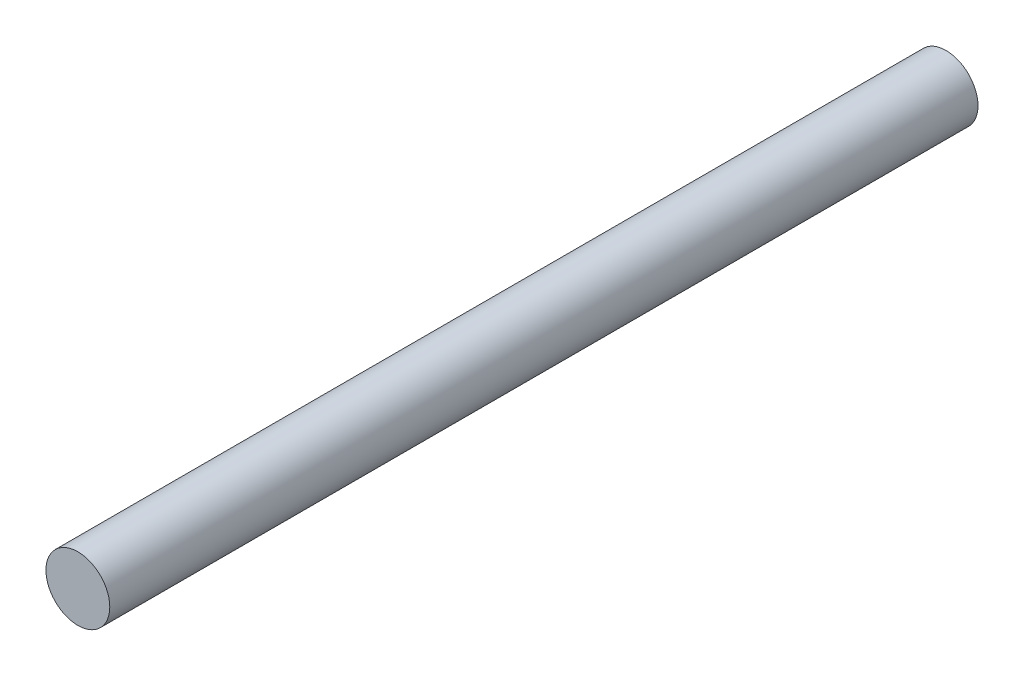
from build123d import *

# Parameters (mm, degrees)
SKETCH_1_R                                   = 2.5
PURCHASED_STEEL_SHAFT_D5_L68_NOT_PRINT_DEPTH = 68


with BuildPart() as part:
    # Sketch 1 → Purchased_steel_shaft_D5_L68_NOT_PRINT (new body)
    with BuildSketch(Plane.XY):
        Circle(SKETCH_1_R)
    extrude(amount=PURCHASED_STEEL_SHAFT_D5_L68_NOT_PRINT_DEPTH)


solid = part.part
